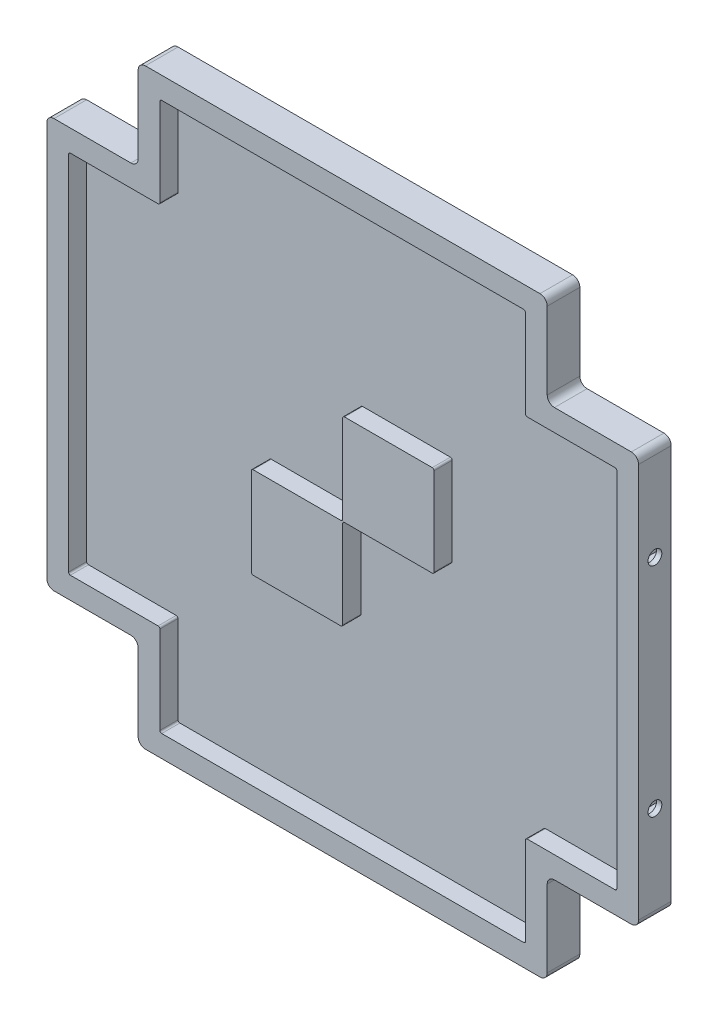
from build123d import *

# Parameters (mm, degrees)
AUFSATZ_LINEAR_AUSTRAGEN1_DEPTH = 9
AUFSATZ_LINEAR_AUSTRAGEN2_DEPTH = 9
SCHNITT_LINEAR_START            = 4
SCHNITT_LINEAR_AUSTRAGEN1_DEPTH = 5
AUFSATZ_LINEAR_AUSTRAGEN4_DEPTH = 5
VERRUNDUNG1_R                   = 0.5
SKIZZE5_W                       = 2.5
SKIZZE5_H                       = 5.6
SCHNITT_LINEAR_AUSTRAGEN2_DEPTH = 7.7
SKIZZE6_R                       = 1.9
SCHNITT_LINEAR_AUSTRAGEN3_DEPTH = 4.65
SCHNITT_LINEAR_AUSTRAGEN4_DEPTH = 3.6
SCHNITT_LINEAR_AUSTRAGEN5_DEPTH = 2
VERRUNDUNG2_R                   = 2


with BuildPart() as part:
    # Skizze1 → Aufsatz-Linear austragen1 (new body)
    with BuildSketch(Plane.XY):
        Polygon((-75.6, 50.4), (-75.6, -50.4), (-50.4, -50.4), (-50.4, -75.6), (50.4, -75.6), (50.4, -50.4), (75.6, -50.4), (75.6, 50.4), (50.4, 50.4), (50.4, 75.6), (-50.4, 75.6), (-50.4, 50.4), align=None)
    extrude(amount=AUFSATZ_LINEAR_AUSTRAGEN1_DEPTH)

    # Skizze3 → Aufsatz-Linear austragen2 (add)
    with BuildSketch(Plane.XY.offset(9)):
        Polygon((56.4, 56.4), (56.4, 81.6), (-56.4, 81.6), (-56.4, 56.4), (-81.6, 56.4), (-81.6, -56.4), (-56.4, -56.4), (-56.4, -81.6), (56.4, -81.6), (56.4, -56.4), (81.6, -56.4), (81.6, 56.4), align=None)
    extrude(amount=-AUFSATZ_LINEAR_AUSTRAGEN2_DEPTH)

    # Skizze1_4 → Schnitt-Linear austragen1 (cut)
    with BuildSketch(Plane.XY.offset(SCHNITT_LINEAR_START)):
        Polygon((-75.6, 50.4), (-75.6, -50.4), (-50.4, -50.4), (-50.4, -75.6), (50.4, -75.6), (50.4, -50.4), (75.6, -50.4), (75.6, 50.4), (50.4, 50.4), (50.4, 75.6), (-50.4, 75.6), (-50.4, 50.4), align=None)
    extrude(amount=SCHNITT_LINEAR_AUSTRAGEN1_DEPTH, mode=Mode.SUBTRACT)

    # Skizze4 → Aufsatz-Linear austragen4 (add)
    with BuildSketch(Plane.XY.offset(4)):
        with BuildLine():
            Line((-25.2, 0), (-25.2, -25.2))
            Line((-25.2, -25.2), (0, -25.2))
            Line((0, -25.2), (0, -0.5))
            ThreePointArc((0, -0.5), (0.146446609, -0.146446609), (0.5, 0))
            Line((0.5, 0), (25.2, 0))
            Line((25.2, 0), (25.2, 25.2))
            Line((25.2, 25.2), (0, 25.2))
            Line((0, 25.2), (0, 0.5))
            ThreePointArc((0, 0.5), (-0.146446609, 0.146446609), (-0.5, 0))
            Line((-0.5, 0), (-25.2, 0))
        make_face()
    extrude(amount=AUFSATZ_LINEAR_AUSTRAGEN4_DEPTH)

    # Verrundung1
    verrundung1_edges = [part.edges().sort_by_distance(p)[0] for p in [
        (-25.2, 0, 6.5),
        (-25.2, -25.2, 6.5),
        (0, -25.2, 6.5),
        (25.2, 0, 6.5),
        (25.2, 25.2, 6.5),
        (0, 25.2, 6.5),
        (-50.4, 50.4, 6.5),
        (-75.6, 50.4, 6.5),
        (-75.6, -50.4, 6.5),
        (-50.4, -50.4, 6.5),
        (-50.4, -75.6, 6.5),
        (50.4, -75.6, 6.5),
        (50.4, -50.4, 6.5),
        (75.6, -50.4, 6.5),
        (75.6, 50.4, 6.5),
        (50.4, 50.4, 6.5),
        (50.4, 75.6, 6.5),
        (-50.4, 75.6, 6.5),
    ]]
    fillet(verrundung1_edges, radius=VERRUNDUNG1_R)

    # Skizze5 → Schnitt-Linear austragen2 (cut)
    with BuildSketch(Plane(origin=(0, 0, 0), x_dir=(-1, 0, 0), z_dir=(0, 0, -1))):
        with Locations((-78.9, 30)):
            Rectangle(SKIZZE5_W, SKIZZE5_H)
        with Locations((-78.9, -30)):
            Rectangle(SKIZZE5_W, SKIZZE5_H)
    schnitt_linear_austragen2 = extrude(amount=-SCHNITT_LINEAR_AUSTRAGEN2_DEPTH, mode=Mode.SUBTRACT)

    # Skizze6 → Schnitt-Linear austragen3 (cut)
    with BuildSketch(Plane(origin=(81.6, 0, 0), x_dir=(0, 0, -1), z_dir=(1, 0, 0))):
        with Locations((-4.5, 30)):
            Circle(SKIZZE6_R)
        with Locations((-4.5, -30)):
            Circle(SKIZZE6_R)
    schnitt_linear_austragen3 = extrude(amount=-SCHNITT_LINEAR_AUSTRAGEN3_DEPTH, mode=Mode.SUBTRACT)

    # Spiegeln2: Schnitt-Linear austragen2, Schnitt-Linear austragen3 across plane
    add(schnitt_linear_austragen2.mirror(Plane(origin=(0, 0, 0), x_dir=(0, 0, 1), z_dir=(1, 0, 0))), mode=Mode.SUBTRACT)
    add(schnitt_linear_austragen3.mirror(Plane(origin=(0, 0, 0), x_dir=(0, 0, 1), z_dir=(1, 0, 0))), mode=Mode.SUBTRACT)

    # Skizze7 → Schnitt-Linear austragen4 (cut)
    with BuildSketch(Plane(origin=(0, 0, 0), x_dir=(-1, 0, 0), z_dir=(0, 0, -1))):
        Polygon((-39.55, 65.15), (-39.55, 60.85), (-36.05, 60.85), (-36.05, 61.05), (-34.25, 61.05), (-34.25, 64.95), (-36.05, 64.95), (-36.05, 65.15), align=None)
        Polygon((-64.75, 39.95), (-64.75, 35.65), (-61.25, 35.65), (-61.25, 35.85), (-59.45, 35.85), (-59.45, 39.75), (-61.25, 39.75), (-61.25, 39.95), align=None)
        Polygon((-14.35, -10.45), (-14.35, -14.75), (-10.85, -14.75), (-10.85, -14.55), (-9.05, -14.55), (-9.05, -10.65), (-10.85, -10.65), (-10.85, -10.45), align=None)
        Polygon((14.35, 14.75), (14.35, 10.45), (10.85, 10.45), (10.85, 10.65), (9.05, 10.65), (9.05, 14.55), (10.85, 14.55), (10.85, 14.75), align=None)
        Polygon((64.75, -35.65), (64.75, -39.95), (61.25, -39.95), (61.25, -39.75), (59.45, -39.75), (59.45, -35.85), (61.25, -35.85), (61.25, -35.65), align=None)
        Polygon((39.55, -60.85), (39.55, -65.15), (36.05, -65.15), (36.05, -64.95), (34.25, -64.95), (34.25, -61.05), (36.05, -61.05), (36.05, -60.85), align=None)
    extrude(amount=-SCHNITT_LINEAR_AUSTRAGEN4_DEPTH, mode=Mode.SUBTRACT)

    # Skizze9 → Schnitt-Linear austragen5 (cut)
    with BuildSketch(Plane(origin=(0, 0, 0), x_dir=(-1, 0, 0), z_dir=(0, 0, -1))):
        Polygon((-1.95, 64.95), (1.95, 64.95), (1.95, 14.55), (9.05, 14.55), (9.05, 10.65), (1.95, 10.65), (1.95, -35.85), (59.45, -35.85), (59.45, -39.75), (1.95, -39.75), (1.95, -61.05), (34.25, -61.05), (34.25, -64.95), (1.95, -64.95), (-1.95, -64.95), (-1.95, -14.55), (-9.05, -14.55), (-9.05, -10.65), (-1.95, -10.65), (-1.95, 35.85), (-59.45, 35.85), (-59.45, 39.75), (-1.95, 39.75), (-1.95, 61.05), (-34.25, 61.05), (-34.25, 64.95), align=None)
    extrude(amount=-SCHNITT_LINEAR_AUSTRAGEN5_DEPTH, mode=Mode.SUBTRACT)

    # Verrundung2
    verrundung2_edges = [part.edges().sort_by_distance(p)[0] for p in [
        (56.4, 56.4, 4.5),
        (81.6, 56.4, 4.5),
        (81.6, -56.4, 4.5),
        (56.4, -56.4, 4.5),
        (56.4, -81.6, 4.5),
        (-56.4, -81.6, 4.5),
        (-56.4, -56.4, 4.5),
        (-81.6, -56.4, 4.5),
        (-81.6, 56.4, 4.5),
        (-56.4, 56.4, 4.5),
        (-56.4, 81.6, 4.5),
        (56.4, 81.6, 4.5),
    ]]
    fillet(verrundung2_edges, radius=VERRUNDUNG2_R)


solid = part.part
